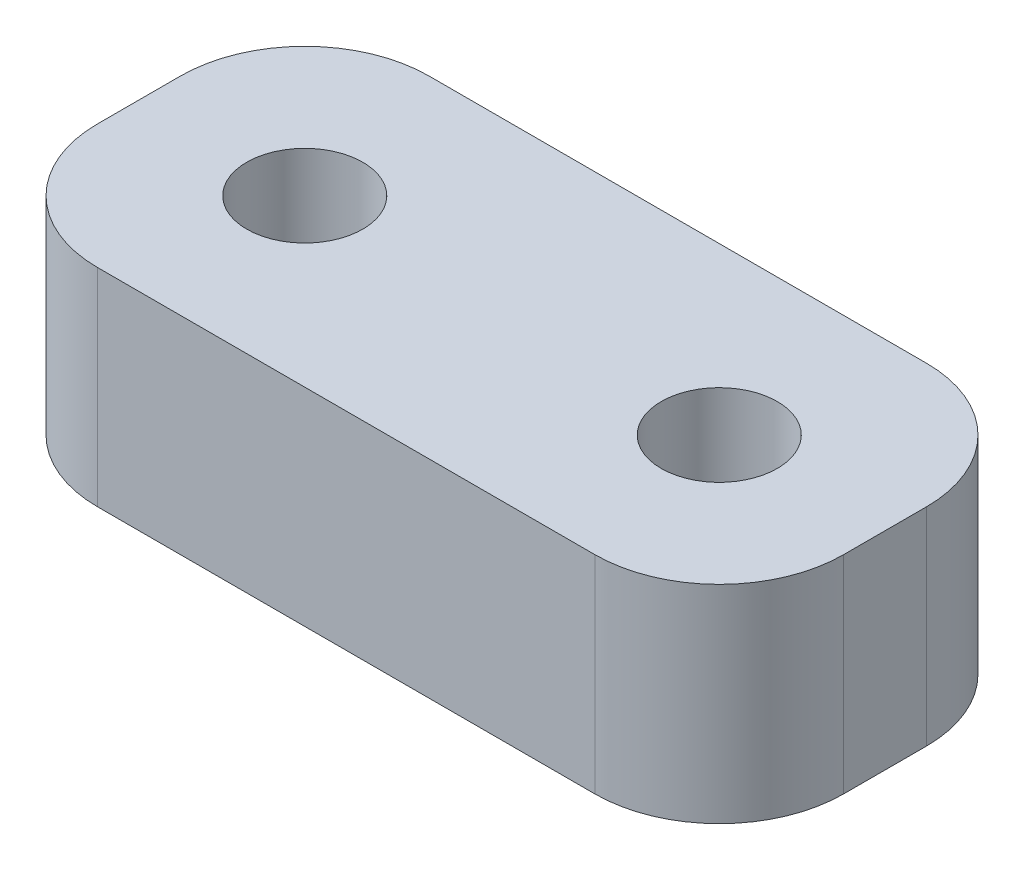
ISO-10303-21;
HEADER;
FILE_DESCRIPTION(('STEP AP214'),'2;1');
FILE_NAME('part.step','',(''),(''),'','','');
FILE_SCHEMA(('AUTOMOTIVE_DESIGN { 1 0 10303 214 1 1 1 1 }'));
ENDSEC;
DATA;
#1=APPLICATION_CONTEXT('core data for automotive mechanical design processes');
#2=APPLICATION_PROTOCOL_DEFINITION('international standard','automotive_design',2000,#1);
#3=PRODUCT_CONTEXT('',#1,'mechanical');
#4=PRODUCT('Part','Part','',(#3));
#5=PRODUCT_RELATED_PRODUCT_CATEGORY('part','',(#4));
#6=PRODUCT_DEFINITION_FORMATION('','',#4);
#7=PRODUCT_DEFINITION_CONTEXT('part definition',#1,'design');
#8=PRODUCT_DEFINITION('design','',#6,#7);
#9=PRODUCT_DEFINITION_SHAPE('','',#8);
#10=(LENGTH_UNIT() NAMED_UNIT(*) SI_UNIT(.MILLI.,.METRE.));
#11=(NAMED_UNIT(*) PLANE_ANGLE_UNIT() SI_UNIT($,.RADIAN.));
#12=(NAMED_UNIT(*) SI_UNIT($,.STERADIAN.) SOLID_ANGLE_UNIT());
#13=UNCERTAINTY_MEASURE_WITH_UNIT(LENGTH_MEASURE(1.E-05),#10,'distance_accuracy_value','');
#14=(GEOMETRIC_REPRESENTATION_CONTEXT(3) GLOBAL_UNCERTAINTY_ASSIGNED_CONTEXT((#13)) GLOBAL_UNIT_ASSIGNED_CONTEXT((#10,
#11,#12)) REPRESENTATION_CONTEXT('',''));
#15=CARTESIAN_POINT('',(0.,0.,0.));
#16=DIRECTION('',(0.,0.,1.));
#17=DIRECTION('',(1.,0.,0.));
#18=AXIS2_PLACEMENT_3D('',#15,#16,#17);
#19=CARTESIAN_POINT('',(0.,5.,0.));
#20=DIRECTION('',(0.,1.,0.));
#21=DIRECTION('',(0.,0.,1.));
#22=AXIS2_PLACEMENT_3D('',#19,#20,#21);
#23=PLANE('',#22);
#24=CARTESIAN_POINT('',(-5.,5.,1.75234738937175));
#25=DIRECTION('',(0.,1.,0.));
#26=DIRECTION('',(0.,0.,1.));
#27=AXIS2_PLACEMENT_3D('',#24,#25,#26);
#28=CIRCLE('',#27,1.4);
#29=CARTESIAN_POINT('',(-5.,5.,3.15234738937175));
#30=VERTEX_POINT('',#29);
#31=EDGE_CURVE('E163',#30,#30,#28,.T.);
#32=ORIENTED_EDGE('',*,*,#31,.F.);
#33=EDGE_LOOP('',(#32));
#34=FACE_BOUND('',#33,.T.);
#35=DIRECTION('',(1.,0.,0.));
#36=VECTOR('',#35,1.);
#37=CARTESIAN_POINT('',(-9.,5.,5.75234738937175));
#38=LINE('',#37,#36);
#39=CARTESIAN_POINT('',(-6.,5.,5.75234738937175));
#40=VERTEX_POINT('',#39);
#41=CARTESIAN_POINT('',(6.,5.,5.75234738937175));
#42=VERTEX_POINT('',#41);
#43=EDGE_CURVE('E170',#40,#42,#38,.T.);
#44=ORIENTED_EDGE('',*,*,#43,.T.);
#45=CARTESIAN_POINT('',(6.,5.,2.75234738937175));
#46=DIRECTION('',(0.,1.,0.));
#47=DIRECTION('',(0.,0.,1.));
#48=AXIS2_PLACEMENT_3D('',#45,#46,#47);
#49=CIRCLE('',#48,3.);
#50=CARTESIAN_POINT('',(9.00000000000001,5.,2.75234738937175));
#51=VERTEX_POINT('',#50);
#52=EDGE_CURVE('E147',#42,#51,#49,.T.);
#53=ORIENTED_EDGE('',*,*,#52,.T.);
#54=DIRECTION('',(0.,0.,-1.));
#55=VECTOR('',#54,1.);
#56=CARTESIAN_POINT('',(9.,5.,-2.24765261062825));
#57=LINE('',#56,#55);
#58=CARTESIAN_POINT('',(9.,5.,0.752347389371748));
#59=VERTEX_POINT('',#58);
#60=EDGE_CURVE('E117',#51,#59,#57,.T.);
#61=ORIENTED_EDGE('',*,*,#60,.T.);
#62=CARTESIAN_POINT('',(6.,5.,0.752347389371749));
#63=DIRECTION('',(0.,1.,0.));
#64=DIRECTION('',(0.,0.,1.));
#65=AXIS2_PLACEMENT_3D('',#62,#63,#64);
#66=CIRCLE('',#65,3.);
#67=CARTESIAN_POINT('',(6.,5.,-2.24765261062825));
#68=VERTEX_POINT('',#67);
#69=EDGE_CURVE('E54',#59,#68,#66,.T.);
#70=ORIENTED_EDGE('',*,*,#69,.T.);
#71=DIRECTION('',(-1.,0.,0.));
#72=VECTOR('',#71,1.);
#73=CARTESIAN_POINT('',(-9.,5.,-2.24765261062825));
#74=LINE('',#73,#72);
#75=CARTESIAN_POINT('',(-6.,5.,-2.24765261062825));
#76=VERTEX_POINT('',#75);
#77=EDGE_CURVE('E133',#68,#76,#74,.T.);
#78=ORIENTED_EDGE('',*,*,#77,.T.);
#79=CARTESIAN_POINT('',(-6.,5.,0.752347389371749));
#80=DIRECTION('',(0.,1.,0.));
#81=DIRECTION('',(0.,0.,1.));
#82=AXIS2_PLACEMENT_3D('',#79,#80,#81);
#83=CIRCLE('',#82,3.);
#84=CARTESIAN_POINT('',(-9.,5.,0.75234738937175));
#85=VERTEX_POINT('',#84);
#86=EDGE_CURVE('E142',#76,#85,#83,.T.);
#87=ORIENTED_EDGE('',*,*,#86,.T.);
#88=DIRECTION('',(0.,0.,1.));
#89=VECTOR('',#88,1.);
#90=CARTESIAN_POINT('',(-9.,5.,-2.24765261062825));
#91=LINE('',#90,#89);
#92=CARTESIAN_POINT('',(-9.,5.,2.75234738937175));
#93=VERTEX_POINT('',#92);
#94=EDGE_CURVE('E127',#85,#93,#91,.T.);
#95=ORIENTED_EDGE('',*,*,#94,.T.);
#96=CARTESIAN_POINT('',(-6.,5.,2.75234738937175));
#97=DIRECTION('',(0.,1.,0.));
#98=DIRECTION('',(0.,0.,1.));
#99=AXIS2_PLACEMENT_3D('',#96,#97,#98);
#100=CIRCLE('',#99,3.);
#101=EDGE_CURVE('E144',#93,#40,#100,.T.);
#102=ORIENTED_EDGE('',*,*,#101,.T.);
#103=EDGE_LOOP('',(#44,#53,#61,#70,#78,#87,#95,#102));
#104=FACE_BOUND('',#103,.T.);
#105=CARTESIAN_POINT('',(5.,5.,1.75234738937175));
#106=DIRECTION('',(0.,1.,0.));
#107=DIRECTION('',(0.,0.,1.));
#108=AXIS2_PLACEMENT_3D('',#105,#106,#107);
#109=CIRCLE('',#108,1.4);
#110=CARTESIAN_POINT('',(5.,5.,3.15234738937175));
#111=VERTEX_POINT('',#110);
#112=EDGE_CURVE('E175',#111,#111,#109,.T.);
#113=ORIENTED_EDGE('',*,*,#112,.F.);
#114=EDGE_LOOP('',(#113));
#115=FACE_BOUND('',#114,.T.);
#116=ADVANCED_FACE('F32',(#34,#104,#115),#23,.T.);
#117=CARTESIAN_POINT('',(0.,0.,0.));
#118=DIRECTION('',(0.,1.,0.));
#119=DIRECTION('',(0.,0.,1.));
#120=AXIS2_PLACEMENT_3D('',#117,#118,#119);
#121=PLANE('',#120);
#122=DIRECTION('',(0.,0.,-1.));
#123=VECTOR('',#122,1.);
#124=CARTESIAN_POINT('',(9.,0.,-2.24765261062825));
#125=LINE('',#124,#123);
#126=CARTESIAN_POINT('',(9.00000000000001,0.,2.75234738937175));
#127=VERTEX_POINT('',#126);
#128=CARTESIAN_POINT('',(9.,0.,0.752347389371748));
#129=VERTEX_POINT('',#128);
#130=EDGE_CURVE('E115',#127,#129,#125,.T.);
#131=ORIENTED_EDGE('',*,*,#130,.F.);
#132=CARTESIAN_POINT('',(6.,0.,2.75234738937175));
#133=DIRECTION('',(0.,1.,0.));
#134=DIRECTION('',(0.,0.,1.));
#135=AXIS2_PLACEMENT_3D('',#132,#133,#134);
#136=CIRCLE('',#135,3.);
#137=CARTESIAN_POINT('',(6.,0.,5.75234738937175));
#138=VERTEX_POINT('',#137);
#139=EDGE_CURVE('E98',#127,#138,#136,.F.);
#140=ORIENTED_EDGE('',*,*,#139,.T.);
#141=DIRECTION('',(1.,0.,0.));
#142=VECTOR('',#141,1.);
#143=CARTESIAN_POINT('',(-9.,0.,5.75234738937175));
#144=LINE('',#143,#142);
#145=CARTESIAN_POINT('',(-6.,0.,5.75234738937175));
#146=VERTEX_POINT('',#145);
#147=EDGE_CURVE('E125',#146,#138,#144,.T.);
#148=ORIENTED_EDGE('',*,*,#147,.F.);
#149=CARTESIAN_POINT('',(-6.,0.,2.75234738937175));
#150=DIRECTION('',(0.,1.,0.));
#151=DIRECTION('',(0.,0.,1.));
#152=AXIS2_PLACEMENT_3D('',#149,#150,#151);
#153=CIRCLE('',#152,3.);
#154=CARTESIAN_POINT('',(-9.,0.,2.75234738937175));
#155=VERTEX_POINT('',#154);
#156=EDGE_CURVE('E136',#146,#155,#153,.F.);
#157=ORIENTED_EDGE('',*,*,#156,.T.);
#158=DIRECTION('',(0.,0.,1.));
#159=VECTOR('',#158,1.);
#160=CARTESIAN_POINT('',(-9.,0.,-2.24765261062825));
#161=LINE('',#160,#159);
#162=CARTESIAN_POINT('',(-9.,0.,0.75234738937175));
#163=VERTEX_POINT('',#162);
#164=EDGE_CURVE('E129',#163,#155,#161,.T.);
#165=ORIENTED_EDGE('',*,*,#164,.F.);
#166=CARTESIAN_POINT('',(-6.,0.,0.752347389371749));
#167=DIRECTION('',(0.,1.,0.));
#168=DIRECTION('',(0.,0.,1.));
#169=AXIS2_PLACEMENT_3D('',#166,#167,#168);
#170=CIRCLE('',#169,3.);
#171=CARTESIAN_POINT('',(-6.,0.,-2.24765261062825));
#172=VERTEX_POINT('',#171);
#173=EDGE_CURVE('E118',#163,#172,#170,.F.);
#174=ORIENTED_EDGE('',*,*,#173,.T.);
#175=DIRECTION('',(-1.,0.,0.));
#176=VECTOR('',#175,1.);
#177=CARTESIAN_POINT('',(-9.,0.,-2.24765261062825));
#178=LINE('',#177,#176);
#179=CARTESIAN_POINT('',(6.,0.,-2.24765261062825));
#180=VERTEX_POINT('',#179);
#181=EDGE_CURVE('E124',#180,#172,#178,.T.);
#182=ORIENTED_EDGE('',*,*,#181,.F.);
#183=CARTESIAN_POINT('',(6.,0.,0.752347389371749));
#184=DIRECTION('',(0.,1.,0.));
#185=DIRECTION('',(0.,0.,1.));
#186=AXIS2_PLACEMENT_3D('',#183,#184,#185);
#187=CIRCLE('',#186,3.);
#188=EDGE_CURVE('E109',#180,#129,#187,.F.);
#189=ORIENTED_EDGE('',*,*,#188,.T.);
#190=EDGE_LOOP('',(#131,#140,#148,#157,#165,#174,#182,#189));
#191=FACE_BOUND('',#190,.T.);
#192=CARTESIAN_POINT('',(-5.,0.,1.75234738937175));
#193=DIRECTION('',(0.,1.,0.));
#194=DIRECTION('',(0.,0.,1.));
#195=AXIS2_PLACEMENT_3D('',#192,#193,#194);
#196=CIRCLE('',#195,1.4);
#197=CARTESIAN_POINT('',(-5.,0.,3.15234738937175));
#198=VERTEX_POINT('',#197);
#199=EDGE_CURVE('E165',#198,#198,#196,.T.);
#200=ORIENTED_EDGE('',*,*,#199,.T.);
#201=EDGE_LOOP('',(#200));
#202=FACE_BOUND('',#201,.T.);
#203=CARTESIAN_POINT('',(5.,0.,1.75234738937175));
#204=DIRECTION('',(0.,1.,0.));
#205=DIRECTION('',(0.,0.,1.));
#206=AXIS2_PLACEMENT_3D('',#203,#204,#205);
#207=CIRCLE('',#206,1.4);
#208=CARTESIAN_POINT('',(5.,0.,3.15234738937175));
#209=VERTEX_POINT('',#208);
#210=EDGE_CURVE('E177',#209,#209,#207,.T.);
#211=ORIENTED_EDGE('',*,*,#210,.T.);
#212=EDGE_LOOP('',(#211));
#213=FACE_BOUND('',#212,.T.);
#214=ADVANCED_FACE('F121',(#191,#202,#213),#121,.F.);
#215=CARTESIAN_POINT('',(-9.,5.,-2.24765261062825));
#216=DIRECTION('',(1.,0.,0.));
#217=DIRECTION('',(0.,0.,-1.));
#218=AXIS2_PLACEMENT_3D('',#215,#216,#217);
#219=PLANE('',#218);
#220=ORIENTED_EDGE('',*,*,#164,.T.);
#221=DIRECTION('',(0.,-1.,0.));
#222=VECTOR('',#221,1.);
#223=CARTESIAN_POINT('',(-9.,5.,2.75234738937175));
#224=LINE('',#223,#222);
#225=EDGE_CURVE('E11',#155,#93,#224,.F.);
#226=ORIENTED_EDGE('',*,*,#225,.T.);
#227=ORIENTED_EDGE('',*,*,#94,.F.);
#228=DIRECTION('',(0.,-1.,0.));
#229=VECTOR('',#228,1.);
#230=CARTESIAN_POINT('',(-9.,5.,0.75234738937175));
#231=LINE('',#230,#229);
#232=EDGE_CURVE('E40',#85,#163,#231,.T.);
#233=ORIENTED_EDGE('',*,*,#232,.T.);
#234=EDGE_LOOP('',(#220,#226,#227,#233));
#235=FACE_BOUND('',#234,.T.);
#236=ADVANCED_FACE('F158',(#235),#219,.F.);
#237=CARTESIAN_POINT('',(-9.,5.,5.75234738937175));
#238=DIRECTION('',(0.,0.,-1.));
#239=DIRECTION('',(-1.,0.,0.));
#240=AXIS2_PLACEMENT_3D('',#237,#238,#239);
#241=PLANE('',#240);
#242=ORIENTED_EDGE('',*,*,#147,.T.);
#243=DIRECTION('',(0.,-1.,0.));
#244=VECTOR('',#243,1.);
#245=CARTESIAN_POINT('',(6.,5.,5.75234738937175));
#246=LINE('',#245,#244);
#247=EDGE_CURVE('E103',#138,#42,#246,.F.);
#248=ORIENTED_EDGE('',*,*,#247,.T.);
#249=ORIENTED_EDGE('',*,*,#43,.F.);
#250=DIRECTION('',(0.,-1.,0.));
#251=VECTOR('',#250,1.);
#252=CARTESIAN_POINT('',(-6.,5.,5.75234738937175));
#253=LINE('',#252,#251);
#254=EDGE_CURVE('E108',#40,#146,#253,.T.);
#255=ORIENTED_EDGE('',*,*,#254,.T.);
#256=EDGE_LOOP('',(#242,#248,#249,#255));
#257=FACE_BOUND('',#256,.T.);
#258=ADVANCED_FACE('F203',(#257),#241,.F.);
#259=CARTESIAN_POINT('',(9.,5.,-2.24765261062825));
#260=DIRECTION('',(-1.,0.,0.));
#261=DIRECTION('',(0.,0.,1.));
#262=AXIS2_PLACEMENT_3D('',#259,#260,#261);
#263=PLANE('',#262);
#264=ORIENTED_EDGE('',*,*,#60,.F.);
#265=DIRECTION('',(0.,-1.,0.));
#266=VECTOR('',#265,1.);
#267=CARTESIAN_POINT('',(9.00000000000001,5.,2.75234738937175));
#268=LINE('',#267,#266);
#269=EDGE_CURVE('E102',#51,#127,#268,.T.);
#270=ORIENTED_EDGE('',*,*,#269,.T.);
#271=ORIENTED_EDGE('',*,*,#130,.T.);
#272=DIRECTION('',(0.,-1.,0.));
#273=VECTOR('',#272,1.);
#274=CARTESIAN_POINT('',(9.,5.,0.752347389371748));
#275=LINE('',#274,#273);
#276=EDGE_CURVE('E119',#129,#59,#275,.F.);
#277=ORIENTED_EDGE('',*,*,#276,.T.);
#278=EDGE_LOOP('',(#264,#270,#271,#277));
#279=FACE_BOUND('',#278,.T.);
#280=ADVANCED_FACE('F114',(#279),#263,.F.);
#281=CARTESIAN_POINT('',(-9.,5.,-2.24765261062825));
#282=DIRECTION('',(0.,0.,1.));
#283=DIRECTION('',(1.,0.,0.));
#284=AXIS2_PLACEMENT_3D('',#281,#282,#283);
#285=PLANE('',#284);
#286=ORIENTED_EDGE('',*,*,#77,.F.);
#287=DIRECTION('',(0.,-1.,0.));
#288=VECTOR('',#287,1.);
#289=CARTESIAN_POINT('',(6.,5.,-2.24765261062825));
#290=LINE('',#289,#288);
#291=EDGE_CURVE('E150',#68,#180,#290,.T.);
#292=ORIENTED_EDGE('',*,*,#291,.T.);
#293=ORIENTED_EDGE('',*,*,#181,.T.);
#294=DIRECTION('',(0.,-1.,0.));
#295=VECTOR('',#294,1.);
#296=CARTESIAN_POINT('',(-6.,5.,-2.24765261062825));
#297=LINE('',#296,#295);
#298=EDGE_CURVE('E47',#172,#76,#297,.F.);
#299=ORIENTED_EDGE('',*,*,#298,.T.);
#300=EDGE_LOOP('',(#286,#292,#293,#299));
#301=FACE_BOUND('',#300,.T.);
#302=ADVANCED_FACE('F198',(#301),#285,.F.);
#303=CARTESIAN_POINT('',(-5.,5.,1.75234738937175));
#304=DIRECTION('',(0.,-1.,0.));
#305=DIRECTION('',(0.,0.,-1.));
#306=AXIS2_PLACEMENT_3D('',#303,#304,#305);
#307=CYLINDRICAL_SURFACE('',#306,1.4);
#308=ORIENTED_EDGE('',*,*,#31,.T.);
#309=EDGE_LOOP('',(#308));
#310=FACE_BOUND('',#309,.T.);
#311=ORIENTED_EDGE('',*,*,#199,.F.);
#312=EDGE_LOOP('',(#311));
#313=FACE_BOUND('',#312,.T.);
#314=ADVANCED_FACE('F195',(#310,#313),#307,.F.);
#315=CARTESIAN_POINT('',(5.,5.,1.75234738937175));
#316=DIRECTION('',(0.,-1.,0.));
#317=DIRECTION('',(0.,0.,-1.));
#318=AXIS2_PLACEMENT_3D('',#315,#316,#317);
#319=CYLINDRICAL_SURFACE('',#318,1.4);
#320=ORIENTED_EDGE('',*,*,#112,.T.);
#321=EDGE_LOOP('',(#320));
#322=FACE_BOUND('',#321,.T.);
#323=ORIENTED_EDGE('',*,*,#210,.F.);
#324=EDGE_LOOP('',(#323));
#325=FACE_BOUND('',#324,.T.);
#326=ADVANCED_FACE('F183',(#322,#325),#319,.F.);
#327=CARTESIAN_POINT('',(6.,5.,2.75234738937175));
#328=DIRECTION('',(0.,-1.,0.));
#329=DIRECTION('',(0.,0.,-1.));
#330=AXIS2_PLACEMENT_3D('',#327,#328,#329);
#331=CYLINDRICAL_SURFACE('',#330,3.);
#332=ORIENTED_EDGE('',*,*,#52,.F.);
#333=ORIENTED_EDGE('',*,*,#247,.F.);
#334=ORIENTED_EDGE('',*,*,#139,.F.);
#335=ORIENTED_EDGE('',*,*,#269,.F.);
#336=EDGE_LOOP('',(#332,#333,#334,#335));
#337=FACE_BOUND('',#336,.T.);
#338=ADVANCED_FACE('F101',(#337),#331,.T.);
#339=CARTESIAN_POINT('',(6.,5.,0.752347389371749));
#340=DIRECTION('',(0.,-1.,0.));
#341=DIRECTION('',(0.,0.,-1.));
#342=AXIS2_PLACEMENT_3D('',#339,#340,#341);
#343=CYLINDRICAL_SURFACE('',#342,3.);
#344=ORIENTED_EDGE('',*,*,#69,.F.);
#345=ORIENTED_EDGE('',*,*,#276,.F.);
#346=ORIENTED_EDGE('',*,*,#188,.F.);
#347=ORIENTED_EDGE('',*,*,#291,.F.);
#348=EDGE_LOOP('',(#344,#345,#346,#347));
#349=FACE_BOUND('',#348,.T.);
#350=ADVANCED_FACE('F211',(#349),#343,.T.);
#351=CARTESIAN_POINT('',(-6.,5.,2.75234738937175));
#352=DIRECTION('',(0.,-1.,0.));
#353=DIRECTION('',(0.,0.,-1.));
#354=AXIS2_PLACEMENT_3D('',#351,#352,#353);
#355=CYLINDRICAL_SURFACE('',#354,3.);
#356=ORIENTED_EDGE('',*,*,#101,.F.);
#357=ORIENTED_EDGE('',*,*,#225,.F.);
#358=ORIENTED_EDGE('',*,*,#156,.F.);
#359=ORIENTED_EDGE('',*,*,#254,.F.);
#360=EDGE_LOOP('',(#356,#357,#358,#359));
#361=FACE_BOUND('',#360,.T.);
#362=ADVANCED_FACE('F213',(#361),#355,.T.);
#363=CARTESIAN_POINT('',(-6.,5.,0.752347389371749));
#364=DIRECTION('',(0.,-1.,0.));
#365=DIRECTION('',(0.,0.,-1.));
#366=AXIS2_PLACEMENT_3D('',#363,#364,#365);
#367=CYLINDRICAL_SURFACE('',#366,3.);
#368=ORIENTED_EDGE('',*,*,#86,.F.);
#369=ORIENTED_EDGE('',*,*,#298,.F.);
#370=ORIENTED_EDGE('',*,*,#173,.F.);
#371=ORIENTED_EDGE('',*,*,#232,.F.);
#372=EDGE_LOOP('',(#368,#369,#370,#371));
#373=FACE_BOUND('',#372,.T.);
#374=ADVANCED_FACE('F34',(#373),#367,.T.);
#375=CLOSED_SHELL('',(#116,#214,#236,#258,#280,#302,#314,#326,#338,#350,#362,#374));
#376=MANIFOLD_SOLID_BREP('B2',#375);
#377=ADVANCED_BREP_SHAPE_REPRESENTATION('',(#18,#376),#14);
#378=SHAPE_DEFINITION_REPRESENTATION(#9,#377);
ENDSEC;
END-ISO-10303-21;
